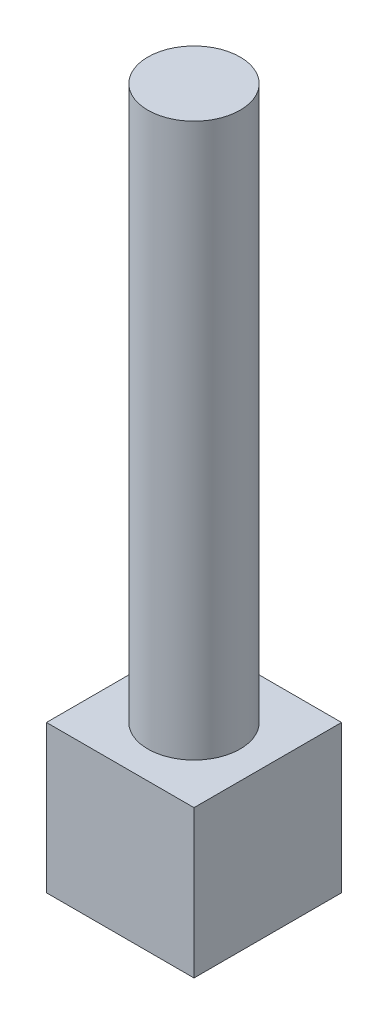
from build123d import *

# Parameters (mm, degrees)
ESQUISSE1_W      = 40
ESQUISSE1_H      = 40
EXTRUSION1_DEPTH = 40
ESQUISSE2_R      = 12.5
EXTRUSION2_DEPTH = 150


with BuildPart() as part:
    # Esquisse1 → Extrusion1 (new body)
    with BuildSketch(Plane.XY):
        with Locations((20, 20)):
            Rectangle(ESQUISSE1_W, ESQUISSE1_H)
    extrude(amount=EXTRUSION1_DEPTH)

    # Esquisse2 → Extrusion2 (add)
    with BuildSketch(Plane(origin=(0, 40, 0), x_dir=(-1, 0, 0), z_dir=(0, 1, 0))):
        with Locations(Location((-20, 20, 0), (0, 0, 270))):
            Circle(ESQUISSE2_R)
    extrude(amount=EXTRUSION2_DEPTH)


solid = part.part
